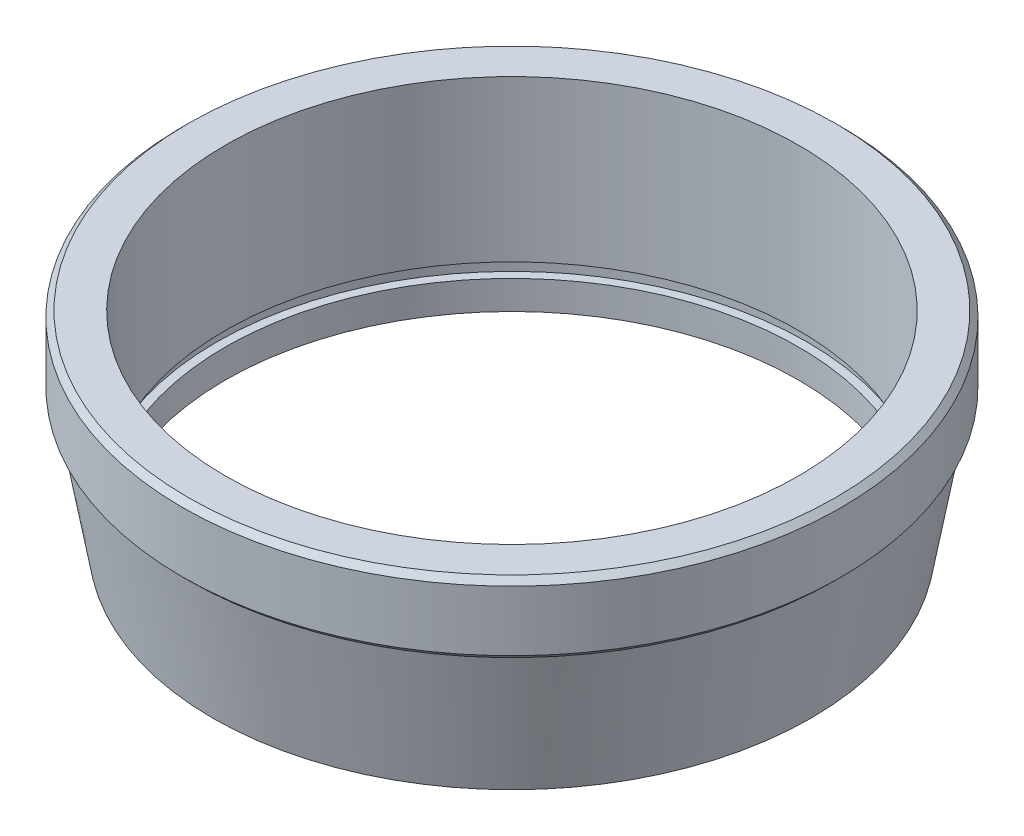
ISO-10303-21;
HEADER;
FILE_DESCRIPTION(('STEP AP214'),'2;1');
FILE_NAME('part.step','',(''),(''),'','','');
FILE_SCHEMA(('AUTOMOTIVE_DESIGN { 1 0 10303 214 1 1 1 1 }'));
ENDSEC;
DATA;
#1=APPLICATION_CONTEXT('core data for automotive mechanical design processes');
#2=APPLICATION_PROTOCOL_DEFINITION('international standard','automotive_design',2000,#1);
#3=PRODUCT_CONTEXT('',#1,'mechanical');
#4=PRODUCT('Part','Part','',(#3));
#5=PRODUCT_RELATED_PRODUCT_CATEGORY('part','',(#4));
#6=PRODUCT_DEFINITION_FORMATION('','',#4);
#7=PRODUCT_DEFINITION_CONTEXT('part definition',#1,'design');
#8=PRODUCT_DEFINITION('design','',#6,#7);
#9=PRODUCT_DEFINITION_SHAPE('','',#8);
#10=(LENGTH_UNIT() NAMED_UNIT(*) SI_UNIT(.MILLI.,.METRE.));
#11=(NAMED_UNIT(*) PLANE_ANGLE_UNIT() SI_UNIT($,.RADIAN.));
#12=(NAMED_UNIT(*) SI_UNIT($,.STERADIAN.) SOLID_ANGLE_UNIT());
#13=UNCERTAINTY_MEASURE_WITH_UNIT(LENGTH_MEASURE(1.E-05),#10,'distance_accuracy_value','');
#14=(GEOMETRIC_REPRESENTATION_CONTEXT(3) GLOBAL_UNCERTAINTY_ASSIGNED_CONTEXT((#13)) GLOBAL_UNIT_ASSIGNED_CONTEXT((#10,
#11,#12)) REPRESENTATION_CONTEXT('',''));
#15=CARTESIAN_POINT('',(0.,0.,0.));
#16=DIRECTION('',(0.,0.,1.));
#17=DIRECTION('',(1.,0.,0.));
#18=AXIS2_PLACEMENT_3D('',#15,#16,#17);
#19=CARTESIAN_POINT('',(0.,0.,0.));
#20=DIRECTION('',(0.,1.,0.));
#21=DIRECTION('',(0.,0.,1.));
#22=AXIS2_PLACEMENT_3D('',#19,#20,#21);
#23=CYLINDRICAL_SURFACE('',#22,10.);
#24=CARTESIAN_POINT('',(0.,-3.1,0.));
#25=DIRECTION('',(0.,1.,0.));
#26=DIRECTION('',(0.,0.,1.));
#27=AXIS2_PLACEMENT_3D('',#24,#25,#26);
#28=CIRCLE('',#27,10.);
#29=CARTESIAN_POINT('',(0.,-3.1,10.));
#30=VERTEX_POINT('',#29);
#31=EDGE_CURVE('E66',#30,#30,#28,.T.);
#32=ORIENTED_EDGE('',*,*,#31,.F.);
#33=EDGE_LOOP('',(#32));
#34=FACE_BOUND('',#33,.T.);
#35=CARTESIAN_POINT('',(0.,2.5,0.));
#36=DIRECTION('',(0.,1.,0.));
#37=DIRECTION('',(0.,0.,1.));
#38=AXIS2_PLACEMENT_3D('',#35,#36,#37);
#39=CIRCLE('',#38,10.);
#40=CARTESIAN_POINT('',(0.,2.5,10.));
#41=VERTEX_POINT('',#40);
#42=EDGE_CURVE('E57',#41,#41,#39,.T.);
#43=ORIENTED_EDGE('',*,*,#42,.T.);
#44=EDGE_LOOP('',(#43));
#45=FACE_BOUND('',#44,.T.);
#46=ADVANCED_FACE('F31',(#34,#45),#23,.F.);
#47=CARTESIAN_POINT('',(0.,0.,0.));
#48=DIRECTION('',(0.,1.,0.));
#49=DIRECTION('',(0.,0.,1.));
#50=AXIS2_PLACEMENT_3D('',#47,#48,#49);
#51=CONICAL_SURFACE('',#50,11.25,0.174532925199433);
#52=CARTESIAN_POINT('',(0.,-4.6,0.));
#53=DIRECTION('',(0.,1.,0.));
#54=DIRECTION('',(0.,0.,1.));
#55=AXIS2_PLACEMENT_3D('',#52,#53,#54);
#56=CIRCLE('',#55,10.4388958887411);
#57=CARTESIAN_POINT('',(0.,-4.6,10.4388958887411));
#58=VERTEX_POINT('',#57);
#59=EDGE_CURVE('E51',#58,#58,#56,.T.);
#60=ORIENTED_EDGE('',*,*,#59,.T.);
#61=EDGE_LOOP('',(#60));
#62=FACE_BOUND('',#61,.T.);
#63=CARTESIAN_POINT('',(0.,0.,0.));
#64=DIRECTION('',(0.,1.,0.));
#65=DIRECTION('',(0.,0.,1.));
#66=AXIS2_PLACEMENT_3D('',#63,#64,#65);
#67=CIRCLE('',#66,11.25);
#68=CARTESIAN_POINT('',(0.,0.,11.25));
#69=VERTEX_POINT('',#68);
#70=EDGE_CURVE('E54',#69,#69,#67,.T.);
#71=ORIENTED_EDGE('',*,*,#70,.F.);
#72=EDGE_LOOP('',(#71));
#73=FACE_BOUND('',#72,.T.);
#74=ADVANCED_FACE('F93',(#62,#73),#51,.T.);
#75=CARTESIAN_POINT('',(0.,-4.6,0.));
#76=DIRECTION('',(0.,1.,0.));
#77=DIRECTION('',(0.,0.,1.));
#78=AXIS2_PLACEMENT_3D('',#75,#76,#77);
#79=PLANE('',#78);
#80=CARTESIAN_POINT('',(0.,-4.6,0.));
#81=DIRECTION('',(0.,-1.,0.));
#82=DIRECTION('',(0.,0.,-1.));
#83=AXIS2_PLACEMENT_3D('',#80,#81,#82);
#84=CIRCLE('',#83,10.);
#85=CARTESIAN_POINT('',(0.,-4.6,-10.));
#86=VERTEX_POINT('',#85);
#87=EDGE_CURVE('E60',#86,#86,#84,.T.);
#88=ORIENTED_EDGE('',*,*,#87,.F.);
#89=EDGE_LOOP('',(#88));
#90=FACE_BOUND('',#89,.T.);
#91=ORIENTED_EDGE('',*,*,#59,.F.);
#92=EDGE_LOOP('',(#91));
#93=FACE_BOUND('',#92,.T.);
#94=ADVANCED_FACE('F108',(#90,#93),#79,.F.);
#95=CARTESIAN_POINT('',(0.,2.5,0.));
#96=DIRECTION('',(0.,-1.,0.));
#97=DIRECTION('',(0.,0.,-1.));
#98=AXIS2_PLACEMENT_3D('',#95,#96,#97);
#99=CYLINDRICAL_SURFACE('',#98,11.5);
#100=CARTESIAN_POINT('',(0.,0.199999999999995,0.));
#101=DIRECTION('',(0.,1.,0.));
#102=DIRECTION('',(0.,0.,1.));
#103=AXIS2_PLACEMENT_3D('',#100,#101,#102);
#104=CIRCLE('',#103,11.5);
#105=CARTESIAN_POINT('',(0.,0.199999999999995,11.5));
#106=VERTEX_POINT('',#105);
#107=EDGE_CURVE('E42',#106,#106,#104,.T.);
#108=ORIENTED_EDGE('',*,*,#107,.T.);
#109=EDGE_LOOP('',(#108));
#110=FACE_BOUND('',#109,.T.);
#111=CARTESIAN_POINT('',(0.,2.30000000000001,0.));
#112=DIRECTION('',(0.,1.,0.));
#113=DIRECTION('',(0.,0.,1.));
#114=AXIS2_PLACEMENT_3D('',#111,#112,#113);
#115=CIRCLE('',#114,11.5);
#116=CARTESIAN_POINT('',(0.,2.30000000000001,11.5));
#117=VERTEX_POINT('',#116);
#118=EDGE_CURVE('E46',#117,#117,#115,.F.);
#119=ORIENTED_EDGE('',*,*,#118,.T.);
#120=EDGE_LOOP('',(#119));
#121=FACE_BOUND('',#120,.T.);
#122=ADVANCED_FACE('F100',(#110,#121),#99,.T.);
#123=CARTESIAN_POINT('',(0.,2.5,0.));
#124=DIRECTION('',(0.,1.,0.));
#125=DIRECTION('',(0.,0.,1.));
#126=AXIS2_PLACEMENT_3D('',#123,#124,#125);
#127=PLANE('',#126);
#128=ORIENTED_EDGE('',*,*,#42,.F.);
#129=EDGE_LOOP('',(#128));
#130=FACE_BOUND('',#129,.T.);
#131=CARTESIAN_POINT('',(0.,2.5,0.));
#132=DIRECTION('',(0.,1.,0.));
#133=DIRECTION('',(0.,0.,1.));
#134=AXIS2_PLACEMENT_3D('',#131,#132,#133);
#135=CIRCLE('',#134,11.3);
#136=CARTESIAN_POINT('',(0.,2.5,11.3));
#137=VERTEX_POINT('',#136);
#138=EDGE_CURVE('E10',#137,#137,#135,.T.);
#139=ORIENTED_EDGE('',*,*,#138,.T.);
#140=EDGE_LOOP('',(#139));
#141=FACE_BOUND('',#140,.T.);
#142=ADVANCED_FACE('F97',(#130,#141),#127,.T.);
#143=CARTESIAN_POINT('',(0.,0.,0.));
#144=DIRECTION('',(0.,1.,0.));
#145=DIRECTION('',(0.,0.,1.));
#146=AXIS2_PLACEMENT_3D('',#143,#144,#145);
#147=PLANE('',#146);
#148=CARTESIAN_POINT('',(0.,0.,0.));
#149=DIRECTION('',(0.,1.,0.));
#150=DIRECTION('',(0.,0.,1.));
#151=AXIS2_PLACEMENT_3D('',#148,#149,#150);
#152=CIRCLE('',#151,11.3);
#153=CARTESIAN_POINT('',(0.,0.,11.3));
#154=VERTEX_POINT('',#153);
#155=EDGE_CURVE('E38',#154,#154,#152,.F.);
#156=ORIENTED_EDGE('',*,*,#155,.T.);
#157=EDGE_LOOP('',(#156));
#158=FACE_BOUND('',#157,.T.);
#159=ORIENTED_EDGE('',*,*,#70,.T.);
#160=EDGE_LOOP('',(#159));
#161=FACE_BOUND('',#160,.T.);
#162=ADVANCED_FACE('F99',(#158,#161),#147,.F.);
#163=CARTESIAN_POINT('',(0.,0.199999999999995,0.));
#164=DIRECTION('',(0.,1.,0.));
#165=DIRECTION('',(0.,0.,1.));
#166=AXIS2_PLACEMENT_3D('',#163,#164,#165);
#167=CONICAL_SURFACE('',#166,11.5,0.785398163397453);
#168=ORIENTED_EDGE('',*,*,#155,.F.);
#169=EDGE_LOOP('',(#168));
#170=FACE_BOUND('',#169,.T.);
#171=ORIENTED_EDGE('',*,*,#107,.F.);
#172=EDGE_LOOP('',(#171));
#173=FACE_BOUND('',#172,.T.);
#174=ADVANCED_FACE('F106',(#170,#173),#167,.T.);
#175=CARTESIAN_POINT('',(0.,2.5,0.));
#176=DIRECTION('',(0.,-1.,0.));
#177=DIRECTION('',(0.,0.,-1.));
#178=AXIS2_PLACEMENT_3D('',#175,#176,#177);
#179=CONICAL_SURFACE('',#178,11.3,0.785398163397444);
#180=ORIENTED_EDGE('',*,*,#118,.F.);
#181=EDGE_LOOP('',(#180));
#182=FACE_BOUND('',#181,.T.);
#183=ORIENTED_EDGE('',*,*,#138,.F.);
#184=EDGE_LOOP('',(#183));
#185=FACE_BOUND('',#184,.T.);
#186=ADVANCED_FACE('F33',(#182,#185),#179,.T.);
#187=CARTESIAN_POINT('',(0.,-3.6,0.));
#188=DIRECTION('',(0.,1.,0.));
#189=DIRECTION('',(0.,0.,1.));
#190=AXIS2_PLACEMENT_3D('',#187,#188,#189);
#191=CIRCLE('',#190,10.);
#192=CARTESIAN_POINT('',(0.,-3.6,10.));
#193=VERTEX_POINT('',#192);
#194=EDGE_CURVE('E69',#193,#193,#191,.T.);
#195=ORIENTED_EDGE('',*,*,#194,.T.);
#196=EDGE_LOOP('',(#195));
#197=FACE_BOUND('',#196,.T.);
#198=ORIENTED_EDGE('',*,*,#87,.T.);
#199=EDGE_LOOP('',(#198));
#200=FACE_BOUND('',#199,.T.);
#201=ADVANCED_FACE('F82',(#197,#200),#23,.F.);
#202=CARTESIAN_POINT('',(0.,2.5,0.));
#203=DIRECTION('',(0.,1.,0.));
#204=DIRECTION('',(0.,0.,1.));
#205=AXIS2_PLACEMENT_3D('',#202,#203,#204);
#206=CYLINDRICAL_SURFACE('',#205,10.3);
#207=CARTESIAN_POINT('',(0.,-3.6,0.));
#208=DIRECTION('',(0.,1.,0.));
#209=DIRECTION('',(0.,0.,1.));
#210=AXIS2_PLACEMENT_3D('',#207,#208,#209);
#211=CIRCLE('',#210,10.3);
#212=CARTESIAN_POINT('',(0.,-3.6,10.3));
#213=VERTEX_POINT('',#212);
#214=EDGE_CURVE('E72',#213,#213,#211,.T.);
#215=ORIENTED_EDGE('',*,*,#214,.F.);
#216=EDGE_LOOP('',(#215));
#217=FACE_BOUND('',#216,.T.);
#218=CARTESIAN_POINT('',(0.,-3.1,0.));
#219=DIRECTION('',(0.,1.,0.));
#220=DIRECTION('',(0.,0.,1.));
#221=AXIS2_PLACEMENT_3D('',#218,#219,#220);
#222=CIRCLE('',#221,10.3);
#223=CARTESIAN_POINT('',(0.,-3.1,10.3));
#224=VERTEX_POINT('',#223);
#225=EDGE_CURVE('E63',#224,#224,#222,.T.);
#226=ORIENTED_EDGE('',*,*,#225,.T.);
#227=EDGE_LOOP('',(#226));
#228=FACE_BOUND('',#227,.T.);
#229=ADVANCED_FACE('F78',(#217,#228),#206,.F.);
#230=CARTESIAN_POINT('',(-10.3,-3.1,0.));
#231=DIRECTION('',(0.,1.,0.));
#232=DIRECTION('',(0.,0.,1.));
#233=AXIS2_PLACEMENT_3D('',#230,#231,#232);
#234=PLANE('',#233);
#235=ORIENTED_EDGE('',*,*,#225,.F.);
#236=EDGE_LOOP('',(#235));
#237=FACE_BOUND('',#236,.T.);
#238=ORIENTED_EDGE('',*,*,#31,.T.);
#239=EDGE_LOOP('',(#238));
#240=FACE_BOUND('',#239,.T.);
#241=ADVANCED_FACE('F81',(#237,#240),#234,.F.);
#242=CARTESIAN_POINT('',(-10.3,-3.6,0.));
#243=DIRECTION('',(0.,-1.,0.));
#244=DIRECTION('',(0.,0.,-1.));
#245=AXIS2_PLACEMENT_3D('',#242,#243,#244);
#246=PLANE('',#245);
#247=ORIENTED_EDGE('',*,*,#194,.F.);
#248=EDGE_LOOP('',(#247));
#249=FACE_BOUND('',#248,.T.);
#250=ORIENTED_EDGE('',*,*,#214,.T.);
#251=EDGE_LOOP('',(#250));
#252=FACE_BOUND('',#251,.T.);
#253=ADVANCED_FACE('F76',(#249,#252),#246,.F.);
#254=CLOSED_SHELL('',(#46,#74,#94,#122,#142,#162,#174,#186,#201,#229,#241,#253));
#255=MANIFOLD_SOLID_BREP('B2',#254);
#256=ADVANCED_BREP_SHAPE_REPRESENTATION('',(#18,#255),#14);
#257=SHAPE_DEFINITION_REPRESENTATION(#9,#256);
ENDSEC;
END-ISO-10303-21;
